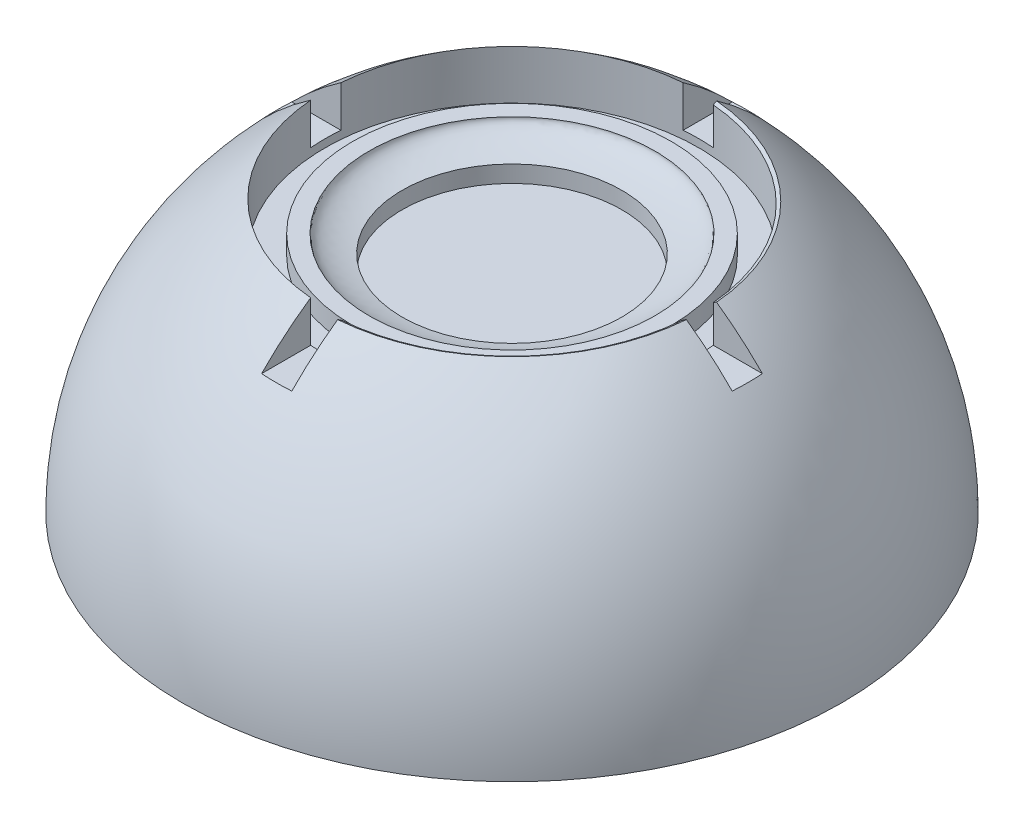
ISO-10303-21;
HEADER;
FILE_DESCRIPTION(('STEP AP214'),'2;1');
FILE_NAME('part.step','',(''),(''),'','','');
FILE_SCHEMA(('AUTOMOTIVE_DESIGN { 1 0 10303 214 1 1 1 1 }'));
ENDSEC;
DATA;
#1=APPLICATION_CONTEXT('core data for automotive mechanical design processes');
#2=APPLICATION_PROTOCOL_DEFINITION('international standard','automotive_design',2000,#1);
#3=PRODUCT_CONTEXT('',#1,'mechanical');
#4=PRODUCT('Part','Part','',(#3));
#5=PRODUCT_RELATED_PRODUCT_CATEGORY('part','',(#4));
#6=PRODUCT_DEFINITION_FORMATION('','',#4);
#7=PRODUCT_DEFINITION_CONTEXT('part definition',#1,'design');
#8=PRODUCT_DEFINITION('design','',#6,#7);
#9=PRODUCT_DEFINITION_SHAPE('','',#8);
#10=(LENGTH_UNIT() NAMED_UNIT(*) SI_UNIT(.MILLI.,.METRE.));
#11=(NAMED_UNIT(*) PLANE_ANGLE_UNIT() SI_UNIT($,.RADIAN.));
#12=(NAMED_UNIT(*) SI_UNIT($,.STERADIAN.) SOLID_ANGLE_UNIT());
#13=UNCERTAINTY_MEASURE_WITH_UNIT(LENGTH_MEASURE(1.E-05),#10,'distance_accuracy_value','');
#14=(GEOMETRIC_REPRESENTATION_CONTEXT(3) GLOBAL_UNCERTAINTY_ASSIGNED_CONTEXT((#13)) GLOBAL_UNIT_ASSIGNED_CONTEXT((#10,
#11,#12)) REPRESENTATION_CONTEXT('',''));
#15=CARTESIAN_POINT('',(0.,0.,0.));
#16=DIRECTION('',(0.,0.,1.));
#17=DIRECTION('',(1.,0.,0.));
#18=AXIS2_PLACEMENT_3D('',#15,#16,#17);
#19=CARTESIAN_POINT('',(0.,6.1,0.));
#20=DIRECTION('',(0.,-1.,0.));
#21=DIRECTION('',(1.,0.,0.));
#22=AXIS2_PLACEMENT_3D('',#19,#20,#21);
#23=CYLINDRICAL_SURFACE('',#22,6.8);
#24=CARTESIAN_POINT('',(0.,8.1,0.));
#25=DIRECTION('',(0.,-1.,0.));
#26=DIRECTION('',(1.,0.,0.));
#27=AXIS2_PLACEMENT_3D('',#24,#25,#26);
#28=CIRCLE('',#27,6.8);
#29=CARTESIAN_POINT('',(6.8,8.1,0.));
#30=VERTEX_POINT('',#29);
#31=EDGE_CURVE('E186',#30,#30,#28,.T.);
#32=ORIENTED_EDGE('',*,*,#31,.T.);
#33=EDGE_LOOP('',(#32));
#34=FACE_BOUND('',#33,.T.);
#35=DIRECTION('',(0.,-1.,0.));
#36=VECTOR('',#35,1.);
#37=CARTESIAN_POINT('',(0.549999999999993,6.1,6.77772085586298));
#38=LINE('',#37,#36);
#39=CARTESIAN_POINT('',(0.549999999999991,8.38736567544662,6.77772085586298));
#40=VERTEX_POINT('',#39);
#41=CARTESIAN_POINT('',(0.549999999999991,9.73736567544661,6.77772085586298));
#42=VERTEX_POINT('',#41);
#43=EDGE_CURVE('E444',#40,#42,#38,.F.);
#44=ORIENTED_EDGE('',*,*,#43,.T.);
#45=CARTESIAN_POINT('',(0.,9.73736567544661,0.));
#46=DIRECTION('',(0.,1.,0.));
#47=DIRECTION('',(-1.,0.,0.));
#48=AXIS2_PLACEMENT_3D('',#45,#46,#47);
#49=CIRCLE('',#48,6.8);
#50=CARTESIAN_POINT('',(6.77772085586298,9.73736567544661,0.550000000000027));
#51=VERTEX_POINT('',#50);
#52=EDGE_CURVE('E56',#42,#51,#49,.T.);
#53=ORIENTED_EDGE('',*,*,#52,.T.);
#54=DIRECTION('',(0.,-1.,0.));
#55=VECTOR('',#54,1.);
#56=CARTESIAN_POINT('',(6.77772085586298,6.1,0.550000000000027));
#57=LINE('',#56,#55);
#58=CARTESIAN_POINT('',(6.77772085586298,8.38736567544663,0.550000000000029));
#59=VERTEX_POINT('',#58);
#60=EDGE_CURVE('E442',#51,#59,#57,.T.);
#61=ORIENTED_EDGE('',*,*,#60,.T.);
#62=CARTESIAN_POINT('',(0.,8.38736567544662,0.));
#63=DIRECTION('',(0.,1.,0.));
#64=DIRECTION('',(-1.,0.,0.));
#65=AXIS2_PLACEMENT_3D('',#62,#63,#64);
#66=CIRCLE('',#65,6.8);
#67=CARTESIAN_POINT('',(6.77772085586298,8.38736567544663,-0.549999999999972));
#68=VERTEX_POINT('',#67);
#69=EDGE_CURVE('E439',#59,#68,#66,.T.);
#70=ORIENTED_EDGE('',*,*,#69,.T.);
#71=DIRECTION('',(0.,-1.,0.));
#72=VECTOR('',#71,1.);
#73=CARTESIAN_POINT('',(6.77772085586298,6.1,-0.549999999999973));
#74=LINE('',#73,#72);
#75=CARTESIAN_POINT('',(6.77772085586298,9.73736567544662,-0.549999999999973));
#76=VERTEX_POINT('',#75);
#77=EDGE_CURVE('E437',#68,#76,#74,.F.);
#78=ORIENTED_EDGE('',*,*,#77,.T.);
#79=CARTESIAN_POINT('',(0.,9.73736567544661,0.));
#80=DIRECTION('',(0.,1.,0.));
#81=DIRECTION('',(-1.,0.,0.));
#82=AXIS2_PLACEMENT_3D('',#79,#80,#81);
#83=CIRCLE('',#82,6.8);
#84=CARTESIAN_POINT('',(0.549999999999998,9.73736567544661,-6.77772085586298));
#85=VERTEX_POINT('',#84);
#86=EDGE_CURVE('E63',#76,#85,#83,.T.);
#87=ORIENTED_EDGE('',*,*,#86,.T.);
#88=DIRECTION('',(0.,-1.,0.));
#89=VECTOR('',#88,1.);
#90=CARTESIAN_POINT('',(0.55,6.1,-6.77772085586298));
#91=LINE('',#90,#89);
#92=CARTESIAN_POINT('',(0.55,8.38736567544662,-6.77772085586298));
#93=VERTEX_POINT('',#92);
#94=EDGE_CURVE('E429',#85,#93,#91,.T.);
#95=ORIENTED_EDGE('',*,*,#94,.T.);
#96=CARTESIAN_POINT('',(0.,8.38736567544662,0.));
#97=DIRECTION('',(0.,1.,0.));
#98=DIRECTION('',(0.,0.,1.));
#99=AXIS2_PLACEMENT_3D('',#96,#97,#98);
#100=CIRCLE('',#99,6.8);
#101=CARTESIAN_POINT('',(-0.55,8.38736567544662,-6.77772085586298));
#102=VERTEX_POINT('',#101);
#103=EDGE_CURVE('E413',#93,#102,#100,.T.);
#104=ORIENTED_EDGE('',*,*,#103,.T.);
#105=DIRECTION('',(0.,-1.,0.));
#106=VECTOR('',#105,1.);
#107=CARTESIAN_POINT('',(-0.55,6.1,-6.77772085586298));
#108=LINE('',#107,#106);
#109=CARTESIAN_POINT('',(-0.55,9.88736567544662,-6.77772085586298));
#110=VERTEX_POINT('',#109);
#111=EDGE_CURVE('E409',#102,#110,#108,.F.);
#112=ORIENTED_EDGE('',*,*,#111,.T.);
#113=CARTESIAN_POINT('',(0.,9.88736567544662,0.));
#114=DIRECTION('',(0.,-1.,0.));
#115=DIRECTION('',(1.,0.,0.));
#116=AXIS2_PLACEMENT_3D('',#113,#114,#115);
#117=CIRCLE('',#116,6.8);
#118=CARTESIAN_POINT('',(-6.77772085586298,9.88736567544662,-0.550000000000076));
#119=VERTEX_POINT('',#118);
#120=EDGE_CURVE('E168',#119,#110,#117,.T.);
#121=ORIENTED_EDGE('',*,*,#120,.F.);
#122=DIRECTION('',(0.,-1.,0.));
#123=VECTOR('',#122,1.);
#124=CARTESIAN_POINT('',(-6.77772085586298,6.1,-0.550000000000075));
#125=LINE('',#124,#123);
#126=CARTESIAN_POINT('',(-6.77772085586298,8.38736567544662,-0.550000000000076));
#127=VERTEX_POINT('',#126);
#128=EDGE_CURVE('E451',#119,#127,#125,.T.);
#129=ORIENTED_EDGE('',*,*,#128,.T.);
#130=CARTESIAN_POINT('',(0.,8.38736567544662,0.));
#131=DIRECTION('',(0.,1.,0.));
#132=DIRECTION('',(0.,0.,1.));
#133=AXIS2_PLACEMENT_3D('',#130,#131,#132);
#134=CIRCLE('',#133,6.8);
#135=CARTESIAN_POINT('',(-6.77772085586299,8.38736567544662,0.549999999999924));
#136=VERTEX_POINT('',#135);
#137=EDGE_CURVE('E160',#127,#136,#134,.T.);
#138=ORIENTED_EDGE('',*,*,#137,.T.);
#139=DIRECTION('',(0.,-1.,0.));
#140=VECTOR('',#139,1.);
#141=CARTESIAN_POINT('',(-6.77772085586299,6.1,0.549999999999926));
#142=LINE('',#141,#140);
#143=CARTESIAN_POINT('',(-6.77772085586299,9.88736567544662,0.549999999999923));
#144=VERTEX_POINT('',#143);
#145=EDGE_CURVE('E146',#136,#144,#142,.F.);
#146=ORIENTED_EDGE('',*,*,#145,.T.);
#147=CARTESIAN_POINT('',(-0.550000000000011,9.88736567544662,6.77772085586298));
#148=VERTEX_POINT('',#147);
#149=EDGE_CURVE('E158',#148,#144,#117,.T.);
#150=ORIENTED_EDGE('',*,*,#149,.F.);
#151=DIRECTION('',(0.,-1.,0.));
#152=VECTOR('',#151,1.);
#153=CARTESIAN_POINT('',(-0.550000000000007,6.1,6.77772085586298));
#154=LINE('',#153,#152);
#155=CARTESIAN_POINT('',(-0.55000000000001,8.38736567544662,6.77772085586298));
#156=VERTEX_POINT('',#155);
#157=EDGE_CURVE('E161',#148,#156,#154,.T.);
#158=ORIENTED_EDGE('',*,*,#157,.T.);
#159=CARTESIAN_POINT('',(0.,8.38736567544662,0.));
#160=DIRECTION('',(0.,1.,0.));
#161=DIRECTION('',(-1.,0.,0.));
#162=AXIS2_PLACEMENT_3D('',#159,#160,#161);
#163=CIRCLE('',#162,6.8);
#164=EDGE_CURVE('E446',#156,#40,#163,.T.);
#165=ORIENTED_EDGE('',*,*,#164,.T.);
#166=EDGE_LOOP('',(#44,#53,#61,#70,#78,#87,#95,#104,#112,#121,#129,#138,#146,#150,#158,#165));
#167=FACE_BOUND('',#166,.T.);
#168=ADVANCED_FACE('F39',(#34,#167),#23,.F.);
#169=CARTESIAN_POINT('',(0.,0.,0.));
#170=DIRECTION('',(0.,-1.,0.));
#171=DIRECTION('',(1.,0.,0.));
#172=AXIS2_PLACEMENT_3D('',#169,#170,#171);
#173=SPHERICAL_SURFACE('',#172,12.);
#174=CARTESIAN_POINT('',(0.,0.,0.));
#175=DIRECTION('',(0.,-1.,0.));
#176=DIRECTION('',(1.,0.,0.));
#177=AXIS2_PLACEMENT_3D('',#174,#175,#176);
#178=CIRCLE('',#177,12.);
#179=CARTESIAN_POINT('',(12.,0.,0.));
#180=VERTEX_POINT('',#179);
#181=EDGE_CURVE('E167',#180,#180,#178,.T.);
#182=ORIENTED_EDGE('',*,*,#181,.F.);
#183=EDGE_LOOP('',(#182));
#184=FACE_BOUND('',#183,.T.);
#185=CARTESIAN_POINT('',(0.,0.,0.550000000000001));
#186=DIRECTION('',(0.,0.,-1.));
#187=DIRECTION('',(-1.,0.,0.));
#188=AXIS2_PLACEMENT_3D('',#185,#186,#187);
#189=CIRCLE('',#188,11.9873892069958);
#190=CARTESIAN_POINT('',(8.56443792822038,8.38736567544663,0.550000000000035));
#191=VERTEX_POINT('',#190);
#192=CARTESIAN_POINT('',(6.89584620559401,9.80534574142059,0.55000000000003));
#193=VERTEX_POINT('',#192);
#194=EDGE_CURVE('E207',#191,#193,#189,.F.);
#195=ORIENTED_EDGE('',*,*,#194,.T.);
#196=CARTESIAN_POINT('',(0.,9.80534574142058,0.));
#197=DIRECTION('',(0.,-1.,0.));
#198=DIRECTION('',(1.,0.,0.));
#199=AXIS2_PLACEMENT_3D('',#196,#197,#198);
#200=CIRCLE('',#199,6.91774492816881);
#201=CARTESIAN_POINT('',(0.549999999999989,9.80534574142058,6.89584620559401));
#202=VERTEX_POINT('',#201);
#203=EDGE_CURVE('E217',#193,#202,#200,.T.);
#204=ORIENTED_EDGE('',*,*,#203,.T.);
#205=CARTESIAN_POINT('',(0.550000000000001,0.,0.));
#206=DIRECTION('',(-1.,0.,0.));
#207=DIRECTION('',(0.,-1.,0.));
#208=AXIS2_PLACEMENT_3D('',#205,#206,#207);
#209=CIRCLE('',#208,11.9873892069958);
#210=CARTESIAN_POINT('',(0.549999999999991,8.38736567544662,8.56443792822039));
#211=VERTEX_POINT('',#210);
#212=EDGE_CURVE('E205',#202,#211,#209,.F.);
#213=ORIENTED_EDGE('',*,*,#212,.T.);
#214=CARTESIAN_POINT('',(0.,8.38736567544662,0.));
#215=DIRECTION('',(0.,1.,0.));
#216=DIRECTION('',(-1.,0.,0.));
#217=AXIS2_PLACEMENT_3D('',#214,#215,#216);
#218=CIRCLE('',#217,8.5820799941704);
#219=CARTESIAN_POINT('',(-0.550000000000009,8.38736567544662,8.56443792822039));
#220=VERTEX_POINT('',#219);
#221=EDGE_CURVE('E203',#211,#220,#218,.F.);
#222=ORIENTED_EDGE('',*,*,#221,.T.);
#223=CARTESIAN_POINT('',(-0.550000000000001,0.,0.));
#224=DIRECTION('',(1.,0.,0.));
#225=DIRECTION('',(0.,1.,0.));
#226=AXIS2_PLACEMENT_3D('',#223,#224,#225);
#227=CIRCLE('',#226,11.9873892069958);
#228=EDGE_CURVE('E152',#220,#148,#227,.F.);
#229=ORIENTED_EDGE('',*,*,#228,.T.);
#230=ORIENTED_EDGE('',*,*,#149,.T.);
#231=CARTESIAN_POINT('',(0.,0.,0.550000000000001));
#232=DIRECTION('',(0.,0.,-1.));
#233=DIRECTION('',(-1.,0.,0.));
#234=AXIS2_PLACEMENT_3D('',#231,#232,#233);
#235=CIRCLE('',#234,11.9873892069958);
#236=CARTESIAN_POINT('',(-8.5644379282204,8.38736567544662,0.549999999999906));
#237=VERTEX_POINT('',#236);
#238=EDGE_CURVE('E143',#144,#237,#235,.F.);
#239=ORIENTED_EDGE('',*,*,#238,.T.);
#240=CARTESIAN_POINT('',(0.,8.38736567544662,0.));
#241=DIRECTION('',(0.,1.,0.));
#242=DIRECTION('',(0.,0.,1.));
#243=AXIS2_PLACEMENT_3D('',#240,#241,#242);
#244=CIRCLE('',#243,8.5820799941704);
#245=CARTESIAN_POINT('',(-8.56443792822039,8.38736567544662,-0.550000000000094));
#246=VERTEX_POINT('',#245);
#247=EDGE_CURVE('E153',#237,#246,#244,.F.);
#248=ORIENTED_EDGE('',*,*,#247,.T.);
#249=CARTESIAN_POINT('',(0.,0.,-0.550000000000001));
#250=DIRECTION('',(0.,0.,1.));
#251=DIRECTION('',(1.,0.,0.));
#252=AXIS2_PLACEMENT_3D('',#249,#250,#251);
#253=CIRCLE('',#252,11.9873892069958);
#254=EDGE_CURVE('E198',#246,#119,#253,.F.);
#255=ORIENTED_EDGE('',*,*,#254,.T.);
#256=ORIENTED_EDGE('',*,*,#120,.T.);
#257=CARTESIAN_POINT('',(-0.550000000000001,0.,0.));
#258=DIRECTION('',(1.,0.,0.));
#259=DIRECTION('',(0.,1.,0.));
#260=AXIS2_PLACEMENT_3D('',#257,#258,#259);
#261=CIRCLE('',#260,11.9873892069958);
#262=CARTESIAN_POINT('',(-0.55,8.38736567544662,-8.56443792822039));
#263=VERTEX_POINT('',#262);
#264=EDGE_CURVE('E195',#110,#263,#261,.F.);
#265=ORIENTED_EDGE('',*,*,#264,.T.);
#266=CARTESIAN_POINT('',(0.,8.38736567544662,0.));
#267=DIRECTION('',(0.,1.,0.));
#268=DIRECTION('',(0.,0.,1.));
#269=AXIS2_PLACEMENT_3D('',#266,#267,#268);
#270=CIRCLE('',#269,8.5820799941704);
#271=CARTESIAN_POINT('',(0.55,8.38736567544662,-8.56443792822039));
#272=VERTEX_POINT('',#271);
#273=EDGE_CURVE('E192',#263,#272,#270,.F.);
#274=ORIENTED_EDGE('',*,*,#273,.T.);
#275=CARTESIAN_POINT('',(0.550000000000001,0.,0.));
#276=DIRECTION('',(-1.,0.,0.));
#277=DIRECTION('',(0.,-1.,0.));
#278=AXIS2_PLACEMENT_3D('',#275,#276,#277);
#279=CIRCLE('',#278,11.9873892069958);
#280=CARTESIAN_POINT('',(0.55,9.80534574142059,-6.895846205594));
#281=VERTEX_POINT('',#280);
#282=EDGE_CURVE('E189',#272,#281,#279,.F.);
#283=ORIENTED_EDGE('',*,*,#282,.T.);
#284=CARTESIAN_POINT('',(0.,9.80534574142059,0.));
#285=DIRECTION('',(0.,-1.,0.));
#286=DIRECTION('',(1.,0.,0.));
#287=AXIS2_PLACEMENT_3D('',#284,#285,#286);
#288=CIRCLE('',#287,6.9177449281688);
#289=CARTESIAN_POINT('',(6.895846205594,9.80534574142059,-0.54999999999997));
#290=VERTEX_POINT('',#289);
#291=EDGE_CURVE('E214',#281,#290,#288,.T.);
#292=ORIENTED_EDGE('',*,*,#291,.T.);
#293=CARTESIAN_POINT('',(0.,0.,-0.550000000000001));
#294=DIRECTION('',(0.,0.,1.));
#295=DIRECTION('',(1.,0.,0.));
#296=AXIS2_PLACEMENT_3D('',#293,#294,#295);
#297=CIRCLE('',#296,11.9873892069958);
#298=CARTESIAN_POINT('',(8.56443792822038,8.38736567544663,-0.549999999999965));
#299=VERTEX_POINT('',#298);
#300=EDGE_CURVE('E212',#290,#299,#297,.F.);
#301=ORIENTED_EDGE('',*,*,#300,.T.);
#302=CARTESIAN_POINT('',(0.,8.38736567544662,0.));
#303=DIRECTION('',(0.,1.,0.));
#304=DIRECTION('',(-1.,0.,0.));
#305=AXIS2_PLACEMENT_3D('',#302,#303,#304);
#306=CIRCLE('',#305,8.5820799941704);
#307=EDGE_CURVE('E209',#299,#191,#306,.F.);
#308=ORIENTED_EDGE('',*,*,#307,.T.);
#309=EDGE_LOOP('',(#195,#204,#213,#222,#229,#230,#239,#248,#255,#256,#265,#274,#283,#292,#301,#308));
#310=FACE_BOUND('',#309,.T.);
#311=ADVANCED_FACE('F165',(#184,#310),#173,.T.);
#312=CARTESIAN_POINT('',(5.8,8.1,0.));
#313=DIRECTION('',(0.,1.,0.));
#314=DIRECTION('',(-1.,0.,0.));
#315=AXIS2_PLACEMENT_3D('',#312,#313,#314);
#316=PLANE('',#315);
#317=CARTESIAN_POINT('',(0.,8.1,0.));
#318=DIRECTION('',(0.,-1.,0.));
#319=DIRECTION('',(1.,0.,0.));
#320=AXIS2_PLACEMENT_3D('',#317,#318,#319);
#321=CIRCLE('',#320,5.8);
#322=CARTESIAN_POINT('',(5.8,8.1,0.));
#323=VERTEX_POINT('',#322);
#324=EDGE_CURVE('E183',#323,#323,#321,.T.);
#325=ORIENTED_EDGE('',*,*,#324,.T.);
#326=EDGE_LOOP('',(#325));
#327=FACE_BOUND('',#326,.T.);
#328=ORIENTED_EDGE('',*,*,#31,.F.);
#329=EDGE_LOOP('',(#328));
#330=FACE_BOUND('',#329,.T.);
#331=ADVANCED_FACE('F294',(#327,#330),#316,.T.);
#332=CARTESIAN_POINT('',(0.,6.1,0.));
#333=DIRECTION('',(0.,-1.,0.));
#334=DIRECTION('',(1.,0.,0.));
#335=AXIS2_PLACEMENT_3D('',#332,#333,#334);
#336=CYLINDRICAL_SURFACE('',#335,5.8);
#337=CARTESIAN_POINT('',(0.,8.8,0.));
#338=DIRECTION('',(0.,-1.,0.));
#339=DIRECTION('',(1.,0.,0.));
#340=AXIS2_PLACEMENT_3D('',#337,#338,#339);
#341=CIRCLE('',#340,5.8);
#342=CARTESIAN_POINT('',(5.8,8.8,0.));
#343=VERTEX_POINT('',#342);
#344=EDGE_CURVE('E180',#343,#343,#341,.T.);
#345=ORIENTED_EDGE('',*,*,#344,.T.);
#346=EDGE_LOOP('',(#345));
#347=FACE_BOUND('',#346,.T.);
#348=ORIENTED_EDGE('',*,*,#324,.F.);
#349=EDGE_LOOP('',(#348));
#350=FACE_BOUND('',#349,.T.);
#351=ADVANCED_FACE('F300',(#347,#350),#336,.T.);
#352=CARTESIAN_POINT('',(5.2,8.8,0.));
#353=DIRECTION('',(0.,1.,0.));
#354=DIRECTION('',(-1.,0.,0.));
#355=AXIS2_PLACEMENT_3D('',#352,#353,#354);
#356=PLANE('',#355);
#357=CARTESIAN_POINT('',(0.,8.8,0.));
#358=DIRECTION('',(0.,-1.,0.));
#359=DIRECTION('',(1.,0.,0.));
#360=AXIS2_PLACEMENT_3D('',#357,#358,#359);
#361=CIRCLE('',#360,5.2);
#362=CARTESIAN_POINT('',(5.2,8.8,0.));
#363=VERTEX_POINT('',#362);
#364=EDGE_CURVE('E171',#363,#363,#361,.T.);
#365=ORIENTED_EDGE('',*,*,#364,.T.);
#366=EDGE_LOOP('',(#365));
#367=FACE_BOUND('',#366,.T.);
#368=ORIENTED_EDGE('',*,*,#344,.F.);
#369=EDGE_LOOP('',(#368));
#370=FACE_BOUND('',#369,.T.);
#371=ADVANCED_FACE('F305',(#367,#370),#356,.T.);
#372=CARTESIAN_POINT('',(0.,8.8,0.));
#373=DIRECTION('',(0.,0.,-1.));
#374=DIRECTION('',(1.,0.,0.));
#375=AXIS2_PLACEMENT_3D('',#372,#373,#374);
#376=ELLIPSE('',#375,5.2,0.999999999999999);
#377=TRIMMED_CURVE('',#376,(PARAMETER_VALUE(-1.5707963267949)),
(PARAMETER_VALUE(1.5707963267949)),.T.,.PARAMETER.);
#378=CARTESIAN_POINT('',(0.,6.1,0.));
#379=DIRECTION('',(0.,-1.,0.));
#380=AXIS1_PLACEMENT('',#378,#379);
#381=SURFACE_OF_REVOLUTION('',#377,#380);
#382=CARTESIAN_POINT('',(0.,8.16102893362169,0.));
#383=DIRECTION('',(0.,-1.,0.));
#384=DIRECTION('',(1.,0.,0.));
#385=AXIS2_PLACEMENT_3D('',#382,#383,#384);
#386=CIRCLE('',#385,4.);
#387=CARTESIAN_POINT('',(0.,8.16102893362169,4.));
#388=VERTEX_POINT('',#387);
#389=EDGE_CURVE('E44',#388,#388,#386,.F.);
#390=ORIENTED_EDGE('',*,*,#389,.F.);
#391=EDGE_LOOP('',(#390));
#392=FACE_BOUND('',#391,.T.);
#393=ORIENTED_EDGE('',*,*,#364,.F.);
#394=EDGE_LOOP('',(#393));
#395=FACE_BOUND('',#394,.T.);
#396=ADVANCED_FACE('F311',(#392,#395),#381,.F.);
#397=CARTESIAN_POINT('',(0.,0.,0.));
#398=DIRECTION('',(0.,-1.,0.));
#399=DIRECTION('',(1.,0.,0.));
#400=AXIS2_PLACEMENT_3D('',#397,#398,#399);
#401=SPHERICAL_SURFACE('',#400,6.1);
#402=CARTESIAN_POINT('',(0.,0.20339178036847,0.));
#403=DIRECTION('',(0.,-1.,0.));
#404=DIRECTION('',(1.,0.,0.));
#405=AXIS2_PLACEMENT_3D('',#402,#403,#404);
#406=CIRCLE('',#405,6.09660821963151);
#407=CARTESIAN_POINT('',(6.09660821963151,0.203391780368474,0.));
#408=VERTEX_POINT('',#407);
#409=EDGE_CURVE('E49',#408,#408,#406,.T.);
#410=ORIENTED_EDGE('',*,*,#409,.T.);
#411=EDGE_LOOP('',(#410));
#412=FACE_BOUND('',#411,.T.);
#413=ADVANCED_FACE('F315',(#412),#401,.F.);
#414=CARTESIAN_POINT('',(6.1,0.,0.));
#415=DIRECTION('',(0.,-1.,0.));
#416=DIRECTION('',(1.,0.,0.));
#417=AXIS2_PLACEMENT_3D('',#414,#415,#416);
#418=PLANE('',#417);
#419=CARTESIAN_POINT('',(0.,0.,0.));
#420=DIRECTION('',(0.,-1.,0.));
#421=DIRECTION('',(1.,0.,0.));
#422=AXIS2_PLACEMENT_3D('',#419,#420,#421);
#423=CIRCLE('',#422,6.29999999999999);
#424=CARTESIAN_POINT('',(6.29999999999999,0.,0.));
#425=VERTEX_POINT('',#424);
#426=EDGE_CURVE('E11',#425,#425,#423,.F.);
#427=ORIENTED_EDGE('',*,*,#426,.T.);
#428=EDGE_LOOP('',(#427));
#429=FACE_BOUND('',#428,.T.);
#430=CARTESIAN_POINT('',(0.,0.,8.));
#431=DIRECTION('',(0.,-1.,0.));
#432=DIRECTION('',(0.,0.,-1.));
#433=AXIS2_PLACEMENT_3D('',#430,#431,#432);
#434=CIRCLE('',#433,1.1);
#435=CARTESIAN_POINT('',(0.,0.,6.9));
#436=VERTEX_POINT('',#435);
#437=EDGE_CURVE('E393',#436,#436,#434,.T.);
#438=ORIENTED_EDGE('',*,*,#437,.F.);
#439=EDGE_LOOP('',(#438));
#440=FACE_BOUND('',#439,.T.);
#441=CARTESIAN_POINT('',(8.,0.,0.));
#442=DIRECTION('',(0.,-1.,0.));
#443=DIRECTION('',(0.,0.,-1.));
#444=AXIS2_PLACEMENT_3D('',#441,#442,#443);
#445=CIRCLE('',#444,1.1);
#446=CARTESIAN_POINT('',(8.,0.,-1.1));
#447=VERTEX_POINT('',#446);
#448=EDGE_CURVE('E397',#447,#447,#445,.T.);
#449=ORIENTED_EDGE('',*,*,#448,.F.);
#450=EDGE_LOOP('',(#449));
#451=FACE_BOUND('',#450,.T.);
#452=CARTESIAN_POINT('',(0.,0.,-8.));
#453=DIRECTION('',(0.,-1.,0.));
#454=DIRECTION('',(0.,0.,-1.));
#455=AXIS2_PLACEMENT_3D('',#452,#453,#454);
#456=CIRCLE('',#455,1.1);
#457=CARTESIAN_POINT('',(0.,0.,-9.1));
#458=VERTEX_POINT('',#457);
#459=EDGE_CURVE('E401',#458,#458,#456,.T.);
#460=ORIENTED_EDGE('',*,*,#459,.F.);
#461=EDGE_LOOP('',(#460));
#462=FACE_BOUND('',#461,.T.);
#463=CARTESIAN_POINT('',(-8.,0.,0.));
#464=DIRECTION('',(0.,-1.,0.));
#465=DIRECTION('',(0.,0.,-1.));
#466=AXIS2_PLACEMENT_3D('',#463,#464,#465);
#467=CIRCLE('',#466,1.1);
#468=CARTESIAN_POINT('',(-8.,0.,-1.1));
#469=VERTEX_POINT('',#468);
#470=EDGE_CURVE('E405',#469,#469,#467,.T.);
#471=ORIENTED_EDGE('',*,*,#470,.F.);
#472=EDGE_LOOP('',(#471));
#473=FACE_BOUND('',#472,.T.);
#474=ORIENTED_EDGE('',*,*,#181,.T.);
#475=EDGE_LOOP('',(#474));
#476=FACE_BOUND('',#475,.T.);
#477=ADVANCED_FACE('F319',(#429,#440,#451,#462,#473,#476),#418,.T.);
#478=CARTESIAN_POINT('',(-8.,3.,0.));
#479=DIRECTION('',(0.,-1.,0.));
#480=DIRECTION('',(0.,0.,-1.));
#481=AXIS2_PLACEMENT_3D('',#478,#479,#480);
#482=CYLINDRICAL_SURFACE('',#481,1.1);
#483=CARTESIAN_POINT('',(-8.,3.,0.));
#484=DIRECTION('',(0.,-1.,0.));
#485=DIRECTION('',(0.,0.,-1.));
#486=AXIS2_PLACEMENT_3D('',#483,#484,#485);
#487=CIRCLE('',#486,1.1);
#488=CARTESIAN_POINT('',(-8.,3.,-1.1));
#489=VERTEX_POINT('',#488);
#490=EDGE_CURVE('E408',#489,#489,#487,.T.);
#491=ORIENTED_EDGE('',*,*,#490,.F.);
#492=EDGE_LOOP('',(#491));
#493=FACE_BOUND('',#492,.T.);
#494=ORIENTED_EDGE('',*,*,#470,.T.);
#495=EDGE_LOOP('',(#494));
#496=FACE_BOUND('',#495,.T.);
#497=ADVANCED_FACE('F322',(#493,#496),#482,.F.);
#498=CARTESIAN_POINT('',(-8.,3.,0.));
#499=DIRECTION('',(0.,-1.,0.));
#500=DIRECTION('',(0.,0.,-1.));
#501=AXIS2_PLACEMENT_3D('',#498,#499,#500);
#502=PLANE('',#501);
#503=ORIENTED_EDGE('',*,*,#490,.T.);
#504=EDGE_LOOP('',(#503));
#505=FACE_BOUND('',#504,.T.);
#506=ADVANCED_FACE('F327',(#505),#502,.T.);
#507=CARTESIAN_POINT('',(0.,3.,-8.));
#508=DIRECTION('',(0.,-1.,0.));
#509=DIRECTION('',(0.,0.,-1.));
#510=AXIS2_PLACEMENT_3D('',#507,#508,#509);
#511=CYLINDRICAL_SURFACE('',#510,1.1);
#512=CARTESIAN_POINT('',(0.,3.,-8.));
#513=DIRECTION('',(0.,-1.,0.));
#514=DIRECTION('',(0.,0.,-1.));
#515=AXIS2_PLACEMENT_3D('',#512,#513,#514);
#516=CIRCLE('',#515,1.1);
#517=CARTESIAN_POINT('',(0.,3.,-9.1));
#518=VERTEX_POINT('',#517);
#519=EDGE_CURVE('E417',#518,#518,#516,.T.);
#520=ORIENTED_EDGE('',*,*,#519,.F.);
#521=EDGE_LOOP('',(#520));
#522=FACE_BOUND('',#521,.T.);
#523=ORIENTED_EDGE('',*,*,#459,.T.);
#524=EDGE_LOOP('',(#523));
#525=FACE_BOUND('',#524,.T.);
#526=ADVANCED_FACE('F331',(#522,#525),#511,.F.);
#527=CARTESIAN_POINT('',(0.,3.,-8.));
#528=DIRECTION('',(0.,-1.,0.));
#529=DIRECTION('',(0.,0.,-1.));
#530=AXIS2_PLACEMENT_3D('',#527,#528,#529);
#531=PLANE('',#530);
#532=ORIENTED_EDGE('',*,*,#519,.T.);
#533=EDGE_LOOP('',(#532));
#534=FACE_BOUND('',#533,.T.);
#535=ADVANCED_FACE('F335',(#534),#531,.T.);
#536=CARTESIAN_POINT('',(8.,3.,0.));
#537=DIRECTION('',(0.,-1.,0.));
#538=DIRECTION('',(0.,0.,-1.));
#539=AXIS2_PLACEMENT_3D('',#536,#537,#538);
#540=CYLINDRICAL_SURFACE('',#539,1.1);
#541=CARTESIAN_POINT('',(8.,3.,0.));
#542=DIRECTION('',(0.,-1.,0.));
#543=DIRECTION('',(0.,0.,-1.));
#544=AXIS2_PLACEMENT_3D('',#541,#542,#543);
#545=CIRCLE('',#544,1.1);
#546=CARTESIAN_POINT('',(8.,3.,-1.1));
#547=VERTEX_POINT('',#546);
#548=EDGE_CURVE('E421',#547,#547,#545,.T.);
#549=ORIENTED_EDGE('',*,*,#548,.F.);
#550=EDGE_LOOP('',(#549));
#551=FACE_BOUND('',#550,.T.);
#552=ORIENTED_EDGE('',*,*,#448,.T.);
#553=EDGE_LOOP('',(#552));
#554=FACE_BOUND('',#553,.T.);
#555=ADVANCED_FACE('F339',(#551,#554),#540,.F.);
#556=CARTESIAN_POINT('',(8.,3.,0.));
#557=DIRECTION('',(0.,-1.,0.));
#558=DIRECTION('',(0.,0.,-1.));
#559=AXIS2_PLACEMENT_3D('',#556,#557,#558);
#560=PLANE('',#559);
#561=ORIENTED_EDGE('',*,*,#548,.T.);
#562=EDGE_LOOP('',(#561));
#563=FACE_BOUND('',#562,.T.);
#564=ADVANCED_FACE('F343',(#563),#560,.T.);
#565=CARTESIAN_POINT('',(0.,3.,8.));
#566=DIRECTION('',(0.,-1.,0.));
#567=DIRECTION('',(0.,0.,-1.));
#568=AXIS2_PLACEMENT_3D('',#565,#566,#567);
#569=CYLINDRICAL_SURFACE('',#568,1.1);
#570=CARTESIAN_POINT('',(0.,3.,8.));
#571=DIRECTION('',(0.,-1.,0.));
#572=DIRECTION('',(0.,0.,-1.));
#573=AXIS2_PLACEMENT_3D('',#570,#571,#572);
#574=CIRCLE('',#573,1.1);
#575=CARTESIAN_POINT('',(0.,3.,6.9));
#576=VERTEX_POINT('',#575);
#577=EDGE_CURVE('E173',#576,#576,#574,.T.);
#578=ORIENTED_EDGE('',*,*,#577,.F.);
#579=EDGE_LOOP('',(#578));
#580=FACE_BOUND('',#579,.T.);
#581=ORIENTED_EDGE('',*,*,#437,.T.);
#582=EDGE_LOOP('',(#581));
#583=FACE_BOUND('',#582,.T.);
#584=ADVANCED_FACE('F347',(#580,#583),#569,.F.);
#585=CARTESIAN_POINT('',(0.,3.,8.));
#586=DIRECTION('',(0.,-1.,0.));
#587=DIRECTION('',(0.,0.,-1.));
#588=AXIS2_PLACEMENT_3D('',#585,#586,#587);
#589=PLANE('',#588);
#590=ORIENTED_EDGE('',*,*,#577,.T.);
#591=EDGE_LOOP('',(#590));
#592=FACE_BOUND('',#591,.T.);
#593=ADVANCED_FACE('F351',(#592),#589,.T.);
#594=CARTESIAN_POINT('',(-0.55,9.88736567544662,-6.5));
#595=DIRECTION('',(1.,0.,0.));
#596=DIRECTION('',(0.,1.,0.));
#597=AXIS2_PLACEMENT_3D('',#594,#595,#596);
#598=PLANE('',#597);
#599=DIRECTION('',(0.,0.,-1.));
#600=VECTOR('',#599,1.);
#601=CARTESIAN_POINT('',(-0.55,8.38736567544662,-6.5));
#602=LINE('',#601,#600);
#603=EDGE_CURVE('E431',#102,#263,#602,.T.);
#604=ORIENTED_EDGE('',*,*,#603,.T.);
#605=ORIENTED_EDGE('',*,*,#264,.F.);
#606=ORIENTED_EDGE('',*,*,#111,.F.);
#607=EDGE_LOOP('',(#604,#605,#606));
#608=FACE_BOUND('',#607,.T.);
#609=ADVANCED_FACE('F355',(#608),#598,.T.);
#610=CARTESIAN_POINT('',(-0.55,8.38736567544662,-6.5));
#611=DIRECTION('',(0.,1.,0.));
#612=DIRECTION('',(0.,0.,1.));
#613=AXIS2_PLACEMENT_3D('',#610,#611,#612);
#614=PLANE('',#613);
#615=DIRECTION('',(0.,0.,-1.));
#616=VECTOR('',#615,1.);
#617=CARTESIAN_POINT('',(0.55,8.38736567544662,-6.5));
#618=LINE('',#617,#616);
#619=EDGE_CURVE('E434',#93,#272,#618,.T.);
#620=ORIENTED_EDGE('',*,*,#619,.T.);
#621=ORIENTED_EDGE('',*,*,#273,.F.);
#622=ORIENTED_EDGE('',*,*,#603,.F.);
#623=ORIENTED_EDGE('',*,*,#103,.F.);
#624=EDGE_LOOP('',(#620,#621,#622,#623));
#625=FACE_BOUND('',#624,.T.);
#626=ADVANCED_FACE('F359',(#625),#614,.T.);
#627=CARTESIAN_POINT('',(0.55,9.88736567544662,-6.5));
#628=DIRECTION('',(-1.,0.,0.));
#629=DIRECTION('',(0.,-1.,0.));
#630=AXIS2_PLACEMENT_3D('',#627,#628,#629);
#631=PLANE('',#630);
#632=ORIENTED_EDGE('',*,*,#94,.F.);
#633=CARTESIAN_POINT('',(0.549999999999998,9.73736567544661,-6.77772085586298));
#634=CARTESIAN_POINT('',(0.549999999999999,9.74869521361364,-6.79740868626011));
#635=CARTESIAN_POINT('',(0.55,9.76002498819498,-6.81709638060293));
#636=CARTESIAN_POINT('',(0.55,9.78268501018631,-6.85647149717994));
#637=CARTESIAN_POINT('',(0.55,9.79401525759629,-6.87615891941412));
#638=CARTESIAN_POINT('',(0.55,9.80534574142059,-6.895846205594));
#639=B_SPLINE_CURVE_WITH_KNOTS('',3,(#633,#634,#635,#636,#637,#638),.UNSPECIFIED.,.F.,.F.,(4,2,
4),(0.,0.0681448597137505,0.13628971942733),.UNSPECIFIED.);
#640=EDGE_CURVE('E370',#85,#281,#639,.T.);
#641=ORIENTED_EDGE('',*,*,#640,.T.);
#642=ORIENTED_EDGE('',*,*,#282,.F.);
#643=ORIENTED_EDGE('',*,*,#619,.F.);
#644=EDGE_LOOP('',(#632,#641,#642,#643));
#645=FACE_BOUND('',#644,.T.);
#646=ADVANCED_FACE('F363',(#645),#631,.T.);
#647=CARTESIAN_POINT('',(-6.50000000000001,9.88736567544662,0.549999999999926));
#648=DIRECTION('',(0.,0.,-1.));
#649=DIRECTION('',(-1.,0.,0.));
#650=AXIS2_PLACEMENT_3D('',#647,#648,#649);
#651=PLANE('',#650);
#652=DIRECTION('',(-1.,0.,0.));
#653=VECTOR('',#652,1.);
#654=CARTESIAN_POINT('',(-6.50000000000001,8.38736567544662,0.549999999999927));
#655=LINE('',#654,#653);
#656=EDGE_CURVE('E148',#136,#237,#655,.T.);
#657=ORIENTED_EDGE('',*,*,#656,.T.);
#658=ORIENTED_EDGE('',*,*,#238,.F.);
#659=ORIENTED_EDGE('',*,*,#145,.F.);
#660=EDGE_LOOP('',(#657,#658,#659));
#661=FACE_BOUND('',#660,.T.);
#662=ADVANCED_FACE('F145',(#661),#651,.T.);
#663=CARTESIAN_POINT('',(-6.50000000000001,8.38736567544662,0.549999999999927));
#664=DIRECTION('',(0.,1.,0.));
#665=DIRECTION('',(0.,0.,1.));
#666=AXIS2_PLACEMENT_3D('',#663,#664,#665);
#667=PLANE('',#666);
#668=DIRECTION('',(-1.,0.,0.));
#669=VECTOR('',#668,1.);
#670=CARTESIAN_POINT('',(-6.5,8.38736567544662,-0.550000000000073));
#671=LINE('',#670,#669);
#672=EDGE_CURVE('E456',#127,#246,#671,.T.);
#673=ORIENTED_EDGE('',*,*,#672,.T.);
#674=ORIENTED_EDGE('',*,*,#247,.F.);
#675=ORIENTED_EDGE('',*,*,#656,.F.);
#676=ORIENTED_EDGE('',*,*,#137,.F.);
#677=EDGE_LOOP('',(#673,#674,#675,#676));
#678=FACE_BOUND('',#677,.T.);
#679=ADVANCED_FACE('F602',(#678),#667,.T.);
#680=CARTESIAN_POINT('',(-6.5,9.88736567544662,-0.550000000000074));
#681=DIRECTION('',(0.,0.,1.));
#682=DIRECTION('',(1.,0.,0.));
#683=AXIS2_PLACEMENT_3D('',#680,#681,#682);
#684=PLANE('',#683);
#685=ORIENTED_EDGE('',*,*,#254,.F.);
#686=ORIENTED_EDGE('',*,*,#672,.F.);
#687=ORIENTED_EDGE('',*,*,#128,.F.);
#688=EDGE_LOOP('',(#685,#686,#687));
#689=FACE_BOUND('',#688,.T.);
#690=ADVANCED_FACE('F286',(#689),#684,.T.);
#691=CARTESIAN_POINT('',(0.549999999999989,9.88736567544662,6.5));
#692=DIRECTION('',(-1.,0.,0.));
#693=DIRECTION('',(0.,-1.,0.));
#694=AXIS2_PLACEMENT_3D('',#691,#692,#693);
#695=PLANE('',#694);
#696=ORIENTED_EDGE('',*,*,#212,.F.);
#697=CARTESIAN_POINT('',(0.549999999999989,9.80534574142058,6.89584620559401));
#698=CARTESIAN_POINT('',(0.549999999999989,9.79401525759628,6.87615891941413));
#699=CARTESIAN_POINT('',(0.549999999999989,9.7826850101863,6.85647149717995));
#700=CARTESIAN_POINT('',(0.549999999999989,9.76002498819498,6.81709638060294));
#701=CARTESIAN_POINT('',(0.549999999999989,9.74869521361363,6.79740868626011));
#702=CARTESIAN_POINT('',(0.549999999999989,9.73736567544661,6.77772085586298));
#703=B_SPLINE_CURVE_WITH_KNOTS('',3,(#697,#698,#699,#700,#701,#702),.UNSPECIFIED.,.F.,.F.,(4,2,
4),(0.,0.0681448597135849,0.136289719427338),.UNSPECIFIED.);
#704=EDGE_CURVE('E220',#202,#42,#703,.T.);
#705=ORIENTED_EDGE('',*,*,#704,.T.);
#706=ORIENTED_EDGE('',*,*,#43,.F.);
#707=DIRECTION('',(0.,0.,1.));
#708=VECTOR('',#707,1.);
#709=CARTESIAN_POINT('',(0.549999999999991,8.38736567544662,6.5));
#710=LINE('',#709,#708);
#711=EDGE_CURVE('E459',#40,#211,#710,.T.);
#712=ORIENTED_EDGE('',*,*,#711,.T.);
#713=EDGE_LOOP('',(#696,#705,#706,#712));
#714=FACE_BOUND('',#713,.T.);
#715=ADVANCED_FACE('F229',(#714),#695,.T.);
#716=CARTESIAN_POINT('',(0.549999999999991,8.38736567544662,6.5));
#717=DIRECTION('',(0.,1.,0.));
#718=DIRECTION('',(-1.,0.,0.));
#719=AXIS2_PLACEMENT_3D('',#716,#717,#718);
#720=PLANE('',#719);
#721=DIRECTION('',(0.,0.,1.));
#722=VECTOR('',#721,1.);
#723=CARTESIAN_POINT('',(-0.55000000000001,8.38736567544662,6.5));
#724=LINE('',#723,#722);
#725=EDGE_CURVE('E455',#156,#220,#724,.T.);
#726=ORIENTED_EDGE('',*,*,#725,.T.);
#727=ORIENTED_EDGE('',*,*,#221,.F.);
#728=ORIENTED_EDGE('',*,*,#711,.F.);
#729=ORIENTED_EDGE('',*,*,#164,.F.);
#730=EDGE_LOOP('',(#726,#727,#728,#729));
#731=FACE_BOUND('',#730,.T.);
#732=ADVANCED_FACE('F279',(#731),#720,.T.);
#733=CARTESIAN_POINT('',(-0.550000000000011,9.88736567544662,6.5));
#734=DIRECTION('',(1.,0.,0.));
#735=DIRECTION('',(0.,1.,0.));
#736=AXIS2_PLACEMENT_3D('',#733,#734,#735);
#737=PLANE('',#736);
#738=ORIENTED_EDGE('',*,*,#228,.F.);
#739=ORIENTED_EDGE('',*,*,#725,.F.);
#740=ORIENTED_EDGE('',*,*,#157,.F.);
#741=EDGE_LOOP('',(#738,#739,#740));
#742=FACE_BOUND('',#741,.T.);
#743=ADVANCED_FACE('F276',(#742),#737,.T.);
#744=CARTESIAN_POINT('',(6.5,9.88736567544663,-0.549999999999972));
#745=DIRECTION('',(0.,0.,1.));
#746=DIRECTION('',(1.,0.,0.));
#747=AXIS2_PLACEMENT_3D('',#744,#745,#746);
#748=PLANE('',#747);
#749=ORIENTED_EDGE('',*,*,#300,.F.);
#750=CARTESIAN_POINT('',(6.895846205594,9.80534574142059,-0.54999999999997));
#751=CARTESIAN_POINT('',(6.87615891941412,9.79401525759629,-0.549999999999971));
#752=CARTESIAN_POINT('',(6.85647149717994,9.78268501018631,-0.549999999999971));
#753=CARTESIAN_POINT('',(6.81709638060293,9.76002498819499,-0.549999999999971));
#754=CARTESIAN_POINT('',(6.79740868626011,9.74869521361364,-0.549999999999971));
#755=CARTESIAN_POINT('',(6.77772085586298,9.73736567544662,-0.549999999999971));
#756=B_SPLINE_CURVE_WITH_KNOTS('',3,(#750,#751,#752,#753,#754,#755),.UNSPECIFIED.,.F.,.F.,(4,2,
4),(0.,0.0681448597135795,0.13628971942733),.UNSPECIFIED.);
#757=EDGE_CURVE('E255',#290,#76,#756,.T.);
#758=ORIENTED_EDGE('',*,*,#757,.T.);
#759=ORIENTED_EDGE('',*,*,#77,.F.);
#760=DIRECTION('',(1.,0.,0.));
#761=VECTOR('',#760,1.);
#762=CARTESIAN_POINT('',(6.5,8.38736567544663,-0.549999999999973));
#763=LINE('',#762,#761);
#764=EDGE_CURVE('E453',#68,#299,#763,.T.);
#765=ORIENTED_EDGE('',*,*,#764,.T.);
#766=EDGE_LOOP('',(#749,#758,#759,#765));
#767=FACE_BOUND('',#766,.T.);
#768=ADVANCED_FACE('F271',(#767),#748,.T.);
#769=CARTESIAN_POINT('',(6.5,8.38736567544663,-0.549999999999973));
#770=DIRECTION('',(0.,1.,0.));
#771=DIRECTION('',(-1.,0.,0.));
#772=AXIS2_PLACEMENT_3D('',#769,#770,#771);
#773=PLANE('',#772);
#774=DIRECTION('',(1.,0.,0.));
#775=VECTOR('',#774,1.);
#776=CARTESIAN_POINT('',(6.49999999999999,8.38736567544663,0.550000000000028));
#777=LINE('',#776,#775);
#778=EDGE_CURVE('E462',#59,#191,#777,.T.);
#779=ORIENTED_EDGE('',*,*,#778,.T.);
#780=ORIENTED_EDGE('',*,*,#307,.F.);
#781=ORIENTED_EDGE('',*,*,#764,.F.);
#782=ORIENTED_EDGE('',*,*,#69,.F.);
#783=EDGE_LOOP('',(#779,#780,#781,#782));
#784=FACE_BOUND('',#783,.T.);
#785=ADVANCED_FACE('F266',(#784),#773,.T.);
#786=CARTESIAN_POINT('',(6.49999999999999,9.88736567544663,0.550000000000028));
#787=DIRECTION('',(0.,0.,-1.));
#788=DIRECTION('',(-1.,0.,0.));
#789=AXIS2_PLACEMENT_3D('',#786,#787,#788);
#790=PLANE('',#789);
#791=ORIENTED_EDGE('',*,*,#60,.F.);
#792=CARTESIAN_POINT('',(6.77772085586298,9.73736567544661,0.550000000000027));
#793=CARTESIAN_POINT('',(6.7974086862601,9.74869521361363,0.550000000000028));
#794=CARTESIAN_POINT('',(6.81709638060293,9.76002498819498,0.550000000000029));
#795=CARTESIAN_POINT('',(6.85647149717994,9.78268501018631,0.55000000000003));
#796=CARTESIAN_POINT('',(6.87615891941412,9.79401525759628,0.55000000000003));
#797=CARTESIAN_POINT('',(6.89584620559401,9.80534574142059,0.55000000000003));
#798=B_SPLINE_CURVE_WITH_KNOTS('',3,(#792,#793,#794,#795,#796,#797),.UNSPECIFIED.,.F.,.F.,(4,2,
4),(0.,0.0681448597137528,0.136289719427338),.UNSPECIFIED.);
#799=EDGE_CURVE('E248',#51,#193,#798,.T.);
#800=ORIENTED_EDGE('',*,*,#799,.T.);
#801=ORIENTED_EDGE('',*,*,#194,.F.);
#802=ORIENTED_EDGE('',*,*,#778,.F.);
#803=EDGE_LOOP('',(#791,#800,#801,#802));
#804=FACE_BOUND('',#803,.T.);
#805=ADVANCED_FACE('F242',(#804),#790,.T.);
#806=CARTESIAN_POINT('',(0.,9.80534574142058,0.));
#807=DIRECTION('',(0.,1.,0.));
#808=DIRECTION('',(-1.,0.,0.));
#809=AXIS2_PLACEMENT_3D('',#806,#807,#808);
#810=CONICAL_SURFACE('',#809,6.91774492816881,1.0471975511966);
#811=ORIENTED_EDGE('',*,*,#799,.F.);
#812=ORIENTED_EDGE('',*,*,#52,.F.);
#813=ORIENTED_EDGE('',*,*,#704,.F.);
#814=ORIENTED_EDGE('',*,*,#203,.F.);
#815=EDGE_LOOP('',(#811,#812,#813,#814));
#816=FACE_BOUND('',#815,.T.);
#817=ADVANCED_FACE('F234',(#816),#810,.F.);
#818=CARTESIAN_POINT('',(0.,9.80534574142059,0.));
#819=DIRECTION('',(0.,1.,0.));
#820=DIRECTION('',(-1.,0.,0.));
#821=AXIS2_PLACEMENT_3D('',#818,#819,#820);
#822=CONICAL_SURFACE('',#821,6.91774492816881,1.04719755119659);
#823=ORIENTED_EDGE('',*,*,#640,.F.);
#824=ORIENTED_EDGE('',*,*,#86,.F.);
#825=ORIENTED_EDGE('',*,*,#757,.F.);
#826=ORIENTED_EDGE('',*,*,#291,.F.);
#827=EDGE_LOOP('',(#823,#824,#825,#826));
#828=FACE_BOUND('',#827,.T.);
#829=ADVANCED_FACE('F241',(#828),#822,.F.);
#830=CARTESIAN_POINT('',(0.,0.203391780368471,0.));
#831=DIRECTION('',(0.,-1.,0.));
#832=DIRECTION('',(1.,0.,0.));
#833=AXIS2_PLACEMENT_3D('',#830,#831,#832);
#834=CONICAL_SURFACE('',#833,6.09660821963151,0.785398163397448);
#835=CARTESIAN_POINT('',(6.29999999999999,0.,0.));
#836=CARTESIAN_POINT('',(6.29788133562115,0.00211866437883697,0.));
#837=CARTESIAN_POINT('',(6.29576267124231,0.00423732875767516,0.));
#838=CARTESIAN_POINT('',(6.29152534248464,0.00847465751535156,0.));
#839=CARTESIAN_POINT('',(6.2894066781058,0.0105933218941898,0.));
#840=CARTESIAN_POINT('',(6.28516934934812,0.0148306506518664,0.));
#841=CARTESIAN_POINT('',(6.28305068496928,0.0169493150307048,0.));
#842=CARTESIAN_POINT('',(6.27881335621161,0.0211866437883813,0.));
#843=CARTESIAN_POINT('',(6.27669469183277,0.0233053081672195,0.));
#844=CARTESIAN_POINT('',(6.27245736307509,0.027542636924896,0.));
#845=CARTESIAN_POINT('',(6.27033869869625,0.0296613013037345,0.));
#846=CARTESIAN_POINT('',(6.26610136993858,0.033898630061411,0.));
#847=CARTESIAN_POINT('',(6.26398270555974,0.0360172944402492,0.));
#848=CARTESIAN_POINT('',(6.25974537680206,0.0402546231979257,0.));
#849=CARTESIAN_POINT('',(6.25762671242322,0.0423732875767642,0.));
#850=CARTESIAN_POINT('',(6.25338938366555,0.0466106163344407,0.));
#851=CARTESIAN_POINT('',(6.25127071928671,0.0487292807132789,0.));
#852=CARTESIAN_POINT('',(6.24703339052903,0.0529666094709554,0.));
#853=CARTESIAN_POINT('',(6.24491472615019,0.0550852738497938,0.));
#854=CARTESIAN_POINT('',(6.24067739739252,0.0593226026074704,0.));
#855=CARTESIAN_POINT('',(6.23855873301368,0.0614412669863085,0.));
#856=CARTESIAN_POINT('',(6.234321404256,0.0656785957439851,0.));
#857=CARTESIAN_POINT('',(6.23220273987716,0.0677972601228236,0.));
#858=CARTESIAN_POINT('',(6.22796541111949,0.0720345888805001,0.));
#859=CARTESIAN_POINT('',(6.22584674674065,0.0741532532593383,0.));
#860=CARTESIAN_POINT('',(6.22160941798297,0.0783905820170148,0.));
#861=CARTESIAN_POINT('',(6.21949075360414,0.0805092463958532,0.));
#862=CARTESIAN_POINT('',(6.21525342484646,0.0847465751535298,0.));
#863=CARTESIAN_POINT('',(6.21313476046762,0.0868652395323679,0.));
#864=CARTESIAN_POINT('',(6.20889743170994,0.0911025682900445,0.));
#865=CARTESIAN_POINT('',(6.20677876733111,0.0932212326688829,0.));
#866=CARTESIAN_POINT('',(6.20254143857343,0.0974585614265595,0.));
#867=CARTESIAN_POINT('',(6.20042277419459,0.0995772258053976,0.));
#868=CARTESIAN_POINT('',(6.19618544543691,0.103814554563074,0.));
#869=CARTESIAN_POINT('',(6.19406678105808,0.105933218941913,0.));
#870=CARTESIAN_POINT('',(6.1898294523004,0.110170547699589,0.));
#871=CARTESIAN_POINT('',(6.18771078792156,0.112289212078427,0.));
#872=CARTESIAN_POINT('',(6.18347345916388,0.116526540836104,0.));
#873=CARTESIAN_POINT('',(6.18135479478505,0.118645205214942,0.));
#874=CARTESIAN_POINT('',(6.17711746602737,0.122882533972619,0.));
#875=CARTESIAN_POINT('',(6.17499880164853,0.125001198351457,0.));
#876=CARTESIAN_POINT('',(6.17076147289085,0.129238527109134,0.));
#877=CARTESIAN_POINT('',(6.16864280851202,0.131357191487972,0.));
#878=CARTESIAN_POINT('',(6.16440547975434,0.135594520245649,0.));
#879=CARTESIAN_POINT('',(6.1622868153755,0.137713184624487,0.));
#880=CARTESIAN_POINT('',(6.15804948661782,0.141950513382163,0.));
#881=CARTESIAN_POINT('',(6.15593082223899,0.144069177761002,0.));
#882=CARTESIAN_POINT('',(6.15169349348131,0.148306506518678,0.));
#883=CARTESIAN_POINT('',(6.14957482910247,0.150425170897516,0.));
#884=CARTESIAN_POINT('',(6.14533750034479,0.154662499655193,0.));
#885=CARTESIAN_POINT('',(6.14321883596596,0.156781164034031,0.));
#886=CARTESIAN_POINT('',(6.13898150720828,0.161018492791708,0.));
#887=CARTESIAN_POINT('',(6.13686284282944,0.163137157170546,0.));
#888=CARTESIAN_POINT('',(6.13262551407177,0.167374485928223,0.));
#889=CARTESIAN_POINT('',(6.13050684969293,0.169493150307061,0.));
#890=CARTESIAN_POINT('',(6.12626952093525,0.173730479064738,0.));
#891=CARTESIAN_POINT('',(6.12415085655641,0.175849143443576,0.));
#892=CARTESIAN_POINT('',(6.11991352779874,0.180086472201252,0.));
#893=CARTESIAN_POINT('',(6.1177948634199,0.182205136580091,0.));
#894=CARTESIAN_POINT('',(6.11355753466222,0.186442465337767,0.));
#895=CARTESIAN_POINT('',(6.11143887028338,0.188561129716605,0.));
#896=CARTESIAN_POINT('',(6.10720154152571,0.192798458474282,0.));
#897=CARTESIAN_POINT('',(6.10508287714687,0.19491712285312,0.));
#898=CARTESIAN_POINT('',(6.10084554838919,0.199154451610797,0.));
#899=CARTESIAN_POINT('',(6.09872688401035,0.201273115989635,0.));
#900=CARTESIAN_POINT('',(6.09660821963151,0.203391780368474,0.));
#901=B_SPLINE_CURVE_WITH_KNOTS('',3,(#835,#836,#837,#838,#839,#840,#841,#842,#843,#844,#845,
#846,#847,#848,#849,#850,#851,#852,#853,#854,#855,#856,#857,#858,#859,#860,#861,#862,#863,#864,
#865,#866,#867,#868,#869,#870,#871,#872,#873,#874,#875,#876,#877,#878,#879,#880,#881,#882,#883,
#884,#885,#886,#887,#888,#889,#890,#891,#892,#893,#894,#895,#896,#897,#898,#899,#900),
.UNSPECIFIED.,.F.,.F.,(4,2,2,2,2,2,2,2,2,2,2,2,2,2,2,2,2,2,2,2,2,2,2,2,2,2,2,2,2,2,2,2,4),(0.,
0.00898873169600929,0.0179774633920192,0.0269661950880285,0.0359549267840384,0.0449436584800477,
0.0539323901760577,0.062921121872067,0.0719098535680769,0.0808985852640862,0.0898873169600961,
0.0988760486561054,0.107864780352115,0.116853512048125,0.125842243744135,0.134830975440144,
0.143819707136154,0.152808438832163,0.161797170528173,0.170785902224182,0.179774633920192,
0.188763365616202,0.197752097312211,0.206740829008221,0.215729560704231,0.22471829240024,
0.23370702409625,0.242695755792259,0.251684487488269,0.260673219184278,0.269661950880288,
0.278650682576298,0.287639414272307),.UNSPECIFIED.);
#902=EDGE_CURVE('BSEAM42',#425,#408,#901,.T.);
#903=ORIENTED_EDGE('',*,*,#426,.F.);
#904=ORIENTED_EDGE('',*,*,#409,.F.);
#905=ORIENTED_EDGE('',*,*,#902,.T.);
#906=ORIENTED_EDGE('',*,*,#902,.F.);
#907=EDGE_LOOP('',(#903,#905,#904,#906));
#908=FACE_BOUND('',#907,.T.);
#909=ADVANCED_FACE('F42',(#908),#834,.F.);
#910=CARTESIAN_POINT('',(0.,7.54800609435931,0.));
#911=DIRECTION('',(0.,1.,0.));
#912=DIRECTION('',(0.,0.,1.));
#913=AXIS2_PLACEMENT_3D('',#910,#911,#912);
#914=CYLINDRICAL_SURFACE('',#913,4.);
#915=CARTESIAN_POINT('',(0.,7.54800609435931,0.));
#916=DIRECTION('',(0.,1.,0.));
#917=DIRECTION('',(0.,0.,1.));
#918=AXIS2_PLACEMENT_3D('',#915,#916,#917);
#919=CIRCLE('',#918,4.);
#920=CARTESIAN_POINT('',(0.,7.54800609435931,4.));
#921=VERTEX_POINT('',#920);
#922=EDGE_CURVE('E468',#921,#921,#919,.T.);
#923=CARTESIAN_POINT('',(0.,8.16102893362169,4.));
#924=CARTESIAN_POINT('',(0.,8.15464327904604,4.));
#925=CARTESIAN_POINT('',(0.,8.14825762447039,4.));
#926=CARTESIAN_POINT('',(0.,8.13548631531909,4.));
#927=CARTESIAN_POINT('',(0.,8.12910066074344,4.));
#928=CARTESIAN_POINT('',(0.,8.11632935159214,4.));
#929=CARTESIAN_POINT('',(0.,8.10994369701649,4.));
#930=CARTESIAN_POINT('',(0.,8.09717238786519,4.));
#931=CARTESIAN_POINT('',(0.,8.09078673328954,4.));
#932=CARTESIAN_POINT('',(0.,8.07801542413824,4.));
#933=CARTESIAN_POINT('',(0.,8.07162976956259,4.));
#934=CARTESIAN_POINT('',(0.,8.05885846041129,4.));
#935=CARTESIAN_POINT('',(0.,8.05247280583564,4.));
#936=CARTESIAN_POINT('',(0.,8.03970149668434,4.));
#937=CARTESIAN_POINT('',(0.,8.03331584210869,4.));
#938=CARTESIAN_POINT('',(0.,8.02054453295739,4.));
#939=CARTESIAN_POINT('',(0.,8.01415887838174,4.));
#940=CARTESIAN_POINT('',(0.,8.00138756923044,4.));
#941=CARTESIAN_POINT('',(0.,7.99500191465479,4.));
#942=CARTESIAN_POINT('',(0.,7.98223060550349,4.));
#943=CARTESIAN_POINT('',(0.,7.97584495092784,4.));
#944=CARTESIAN_POINT('',(0.,7.96307364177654,4.));
#945=CARTESIAN_POINT('',(0.,7.9566879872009,4.));
#946=CARTESIAN_POINT('',(0.,7.9439166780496,4.));
#947=CARTESIAN_POINT('',(0.,7.93753102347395,4.));
#948=CARTESIAN_POINT('',(0.,7.92475971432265,4.));
#949=CARTESIAN_POINT('',(0.,7.918374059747,4.));
#950=CARTESIAN_POINT('',(0.,7.9056027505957,4.));
#951=CARTESIAN_POINT('',(0.,7.89921709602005,4.));
#952=CARTESIAN_POINT('',(0.,7.88644578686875,4.));
#953=CARTESIAN_POINT('',(0.,7.8800601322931,4.));
#954=CARTESIAN_POINT('',(0.,7.8672888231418,4.));
#955=CARTESIAN_POINT('',(0.,7.86090316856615,4.));
#956=CARTESIAN_POINT('',(0.,7.84813185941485,4.));
#957=CARTESIAN_POINT('',(0.,7.8417462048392,4.));
#958=CARTESIAN_POINT('',(0.,7.8289748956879,4.));
#959=CARTESIAN_POINT('',(0.,7.82258924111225,4.));
#960=CARTESIAN_POINT('',(0.,7.80981793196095,4.));
#961=CARTESIAN_POINT('',(0.,7.8034322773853,4.));
#962=CARTESIAN_POINT('',(0.,7.790660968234,4.));
#963=CARTESIAN_POINT('',(0.,7.78427531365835,4.));
#964=CARTESIAN_POINT('',(0.,7.77150400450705,4.));
#965=CARTESIAN_POINT('',(0.,7.7651183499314,4.));
#966=CARTESIAN_POINT('',(0.,7.7523470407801,4.));
#967=CARTESIAN_POINT('',(0.,7.74596138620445,4.));
#968=CARTESIAN_POINT('',(0.,7.73319007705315,4.));
#969=CARTESIAN_POINT('',(0.,7.72680442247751,4.));
#970=CARTESIAN_POINT('',(0.,7.71403311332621,4.));
#971=CARTESIAN_POINT('',(0.,7.70764745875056,4.));
#972=CARTESIAN_POINT('',(0.,7.69487614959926,4.));
#973=CARTESIAN_POINT('',(0.,7.68849049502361,4.));
#974=CARTESIAN_POINT('',(0.,7.67571918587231,4.));
#975=CARTESIAN_POINT('',(0.,7.66933353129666,4.));
#976=CARTESIAN_POINT('',(0.,7.65656222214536,4.));
#977=CARTESIAN_POINT('',(0.,7.65017656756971,4.));
#978=CARTESIAN_POINT('',(0.,7.63740525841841,4.));
#979=CARTESIAN_POINT('',(0.,7.63101960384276,4.));
#980=CARTESIAN_POINT('',(0.,7.61824829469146,4.));
#981=CARTESIAN_POINT('',(0.,7.61186264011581,4.));
#982=CARTESIAN_POINT('',(0.,7.59909133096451,4.));
#983=CARTESIAN_POINT('',(0.,7.59270567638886,4.));
#984=CARTESIAN_POINT('',(0.,7.57993436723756,4.));
#985=CARTESIAN_POINT('',(0.,7.57354871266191,4.));
#986=CARTESIAN_POINT('',(0.,7.56077740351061,4.));
#987=CARTESIAN_POINT('',(0.,7.55439174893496,4.));
#988=CARTESIAN_POINT('',(0.,7.54800609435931,4.));
#989=B_SPLINE_CURVE_WITH_KNOTS('',3,(#923,#924,#925,#926,#927,#928,#929,#930,#931,#932,#933,
#934,#935,#936,#937,#938,#939,#940,#941,#942,#943,#944,#945,#946,#947,#948,#949,#950,#951,#952,
#953,#954,#955,#956,#957,#958,#959,#960,#961,#962,#963,#964,#965,#966,#967,#968,#969,#970,#971,
#972,#973,#974,#975,#976,#977,#978,#979,#980,#981,#982,#983,#984,#985,#986,#987,#988),
.UNSPECIFIED.,.F.,.F.,(4,2,2,2,2,2,2,2,2,2,2,2,2,2,2,2,2,2,2,2,2,2,2,2,2,2,2,2,2,2,2,2,4),(0.,
0.0191569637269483,0.0383139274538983,0.0574708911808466,0.0766278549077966,0.0957848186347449,
0.114941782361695,0.134098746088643,0.153255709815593,0.172412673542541,0.191569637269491,
0.21072660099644,0.22988356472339,0.249040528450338,0.268197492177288,0.287354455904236,
0.306511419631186,0.325668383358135,0.344825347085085,0.363982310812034,0.383139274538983,
0.402296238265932,0.421453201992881,0.44061016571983,0.459767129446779,0.478924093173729,
0.498081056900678,0.517238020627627,0.536394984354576,0.555551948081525,0.574708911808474,
0.593865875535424,0.613022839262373),.UNSPECIFIED.);
#990=EDGE_CURVE('BSEAM268',#388,#921,#989,.T.);
#991=ORIENTED_EDGE('',*,*,#389,.T.);
#992=ORIENTED_EDGE('',*,*,#922,.F.);
#993=ORIENTED_EDGE('',*,*,#990,.T.);
#994=ORIENTED_EDGE('',*,*,#990,.F.);
#995=EDGE_LOOP('',(#991,#993,#992,#994));
#996=FACE_BOUND('',#995,.T.);
#997=ADVANCED_FACE('F268',(#996),#914,.F.);
#998=CARTESIAN_POINT('',(0.,7.54800609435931,0.));
#999=DIRECTION('',(0.,1.,0.));
#1000=DIRECTION('',(0.,0.,1.));
#1001=AXIS2_PLACEMENT_3D('',#998,#999,#1000);
#1002=PLANE('',#1001);
#1003=ORIENTED_EDGE('',*,*,#922,.T.);
#1004=EDGE_LOOP('',(#1003));
#1005=FACE_BOUND('',#1004,.T.);
#1006=ADVANCED_FACE('F385',(#1005),#1002,.T.);
#1007=CLOSED_SHELL('',(#168,#311,#331,#351,#371,#396,#413,#477,#497,#506,#526,#535,#555,#564,
#584,#593,#609,#626,#646,#662,#679,#690,#715,#732,#743,#768,#785,#805,#817,#829,#909,#997,#1006));
#1008=MANIFOLD_SOLID_BREP('B2',#1007);
#1009=ADVANCED_BREP_SHAPE_REPRESENTATION('',(#18,#1008),#14);
#1010=SHAPE_DEFINITION_REPRESENTATION(#9,#1009);
ENDSEC;
END-ISO-10303-21;
